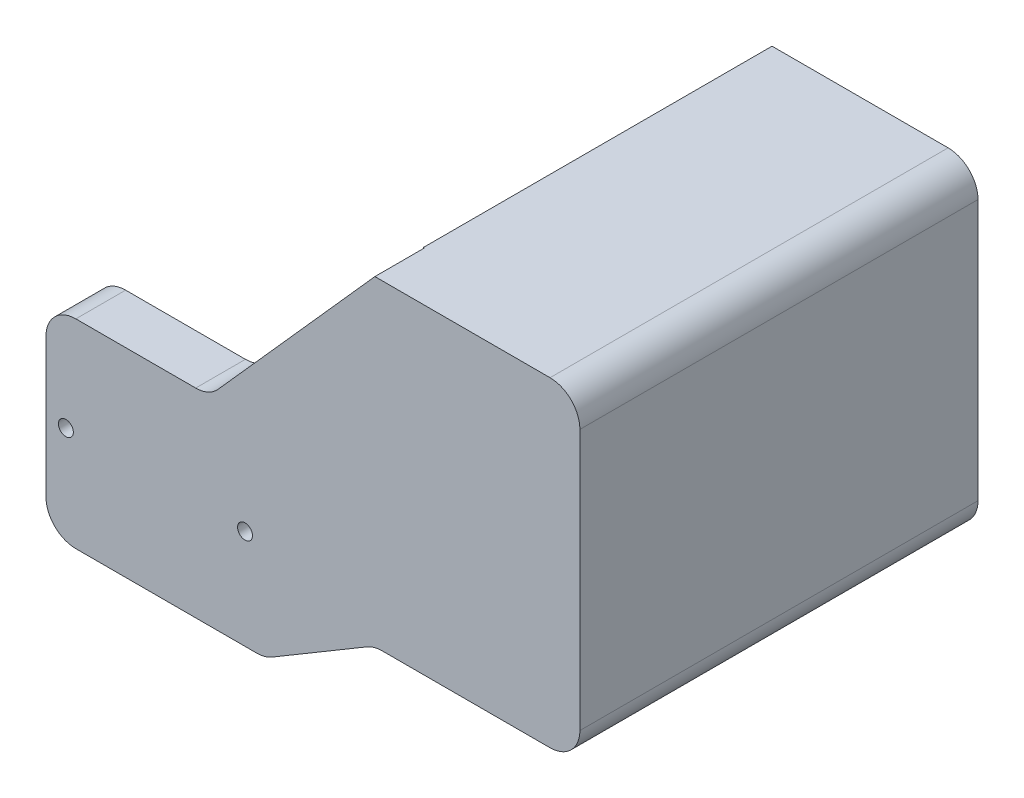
ISO-10303-21;
HEADER;
FILE_DESCRIPTION(('STEP AP214'),'2;1');
FILE_NAME('part.step','',(''),(''),'','','');
FILE_SCHEMA(('AUTOMOTIVE_DESIGN { 1 0 10303 214 1 1 1 1 }'));
ENDSEC;
DATA;
#1=APPLICATION_CONTEXT('core data for automotive mechanical design processes');
#2=APPLICATION_PROTOCOL_DEFINITION('international standard','automotive_design',2000,#1);
#3=PRODUCT_CONTEXT('',#1,'mechanical');
#4=PRODUCT('Part','Part','',(#3));
#5=PRODUCT_RELATED_PRODUCT_CATEGORY('part','',(#4));
#6=PRODUCT_DEFINITION_FORMATION('','',#4);
#7=PRODUCT_DEFINITION_CONTEXT('part definition',#1,'design');
#8=PRODUCT_DEFINITION('design','',#6,#7);
#9=PRODUCT_DEFINITION_SHAPE('','',#8);
#10=(LENGTH_UNIT() NAMED_UNIT(*) SI_UNIT(.MILLI.,.METRE.));
#11=(NAMED_UNIT(*) PLANE_ANGLE_UNIT() SI_UNIT($,.RADIAN.));
#12=(NAMED_UNIT(*) SI_UNIT($,.STERADIAN.) SOLID_ANGLE_UNIT());
#13=UNCERTAINTY_MEASURE_WITH_UNIT(LENGTH_MEASURE(1.E-05),#10,'distance_accuracy_value','');
#14=(GEOMETRIC_REPRESENTATION_CONTEXT(3) GLOBAL_UNCERTAINTY_ASSIGNED_CONTEXT((#13)) GLOBAL_UNIT_ASSIGNED_CONTEXT((#10,
#11,#12)) REPRESENTATION_CONTEXT('',''));
#15=CARTESIAN_POINT('',(0.,0.,0.));
#16=DIRECTION('',(0.,0.,1.));
#17=DIRECTION('',(1.,0.,0.));
#18=AXIS2_PLACEMENT_3D('',#15,#16,#17);
#19=CARTESIAN_POINT('',(22.0454367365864,28.7041033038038,0.));
#20=DIRECTION('',(-0.746732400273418,0.665124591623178,0.));
#21=DIRECTION('',(-0.665124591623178,-0.746732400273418,0.));
#22=AXIS2_PLACEMENT_3D('',#19,#20,#21);
#23=PLANE('',#22);
#24=DIRECTION('',(0.665124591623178,0.746732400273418,0.));
#25=VECTOR('',#24,1.);
#26=CARTESIAN_POINT('',(22.0454367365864,28.7041033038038,0.0200000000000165));
#27=LINE('',#26,#25);
#28=CARTESIAN_POINT('',(21.95,28.596956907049,0.0200000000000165));
#29=VERTEX_POINT('',#28);
#30=CARTESIAN_POINT('',(22.0454367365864,28.7041033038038,0.0200000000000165));
#31=VERTEX_POINT('',#30);
#32=EDGE_CURVE('E11',#29,#31,#27,.T.);
#33=ORIENTED_EDGE('',*,*,#32,.F.);
#34=DIRECTION('',(0.,0.,-1.));
#35=VECTOR('',#34,1.);
#36=CARTESIAN_POINT('',(21.95,28.596956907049,0.));
#37=LINE('',#36,#35);
#38=CARTESIAN_POINT('',(21.95,28.596956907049,0.));
#39=VERTEX_POINT('',#38);
#40=EDGE_CURVE('E538',#29,#39,#37,.T.);
#41=ORIENTED_EDGE('',*,*,#40,.T.);
#42=DIRECTION('',(-0.665124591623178,-0.746732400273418,0.));
#43=VECTOR('',#42,1.);
#44=CARTESIAN_POINT('',(22.0454367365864,28.7041033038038,0.));
#45=LINE('',#44,#43);
#46=CARTESIAN_POINT('',(6.28027446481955,11.0046262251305,0.));
#47=VERTEX_POINT('',#46);
#48=EDGE_CURVE('E222',#39,#47,#45,.T.);
#49=ORIENTED_EDGE('',*,*,#48,.T.);
#50=DIRECTION('',(0.,0.,1.));
#51=VECTOR('',#50,1.);
#52=CARTESIAN_POINT('',(6.28027446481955,11.0046262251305,5.));
#53=LINE('',#52,#51);
#54=CARTESIAN_POINT('',(6.28027446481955,11.0046262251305,5.));
#55=VERTEX_POINT('',#54);
#56=EDGE_CURVE('E358',#47,#55,#53,.T.);
#57=ORIENTED_EDGE('',*,*,#56,.T.);
#58=DIRECTION('',(-0.665124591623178,-0.746732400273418,0.));
#59=VECTOR('',#58,1.);
#60=CARTESIAN_POINT('',(22.0454367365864,28.7041033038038,5.));
#61=LINE('',#60,#59);
#62=CARTESIAN_POINT('',(22.0454367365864,28.7041033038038,5.));
#63=VERTEX_POINT('',#62);
#64=EDGE_CURVE('E219',#63,#55,#61,.T.);
#65=ORIENTED_EDGE('',*,*,#64,.F.);
#66=DIRECTION('',(0.,0.,1.));
#67=VECTOR('',#66,1.);
#68=CARTESIAN_POINT('',(22.0454367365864,28.7041033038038,0.));
#69=LINE('',#68,#67);
#70=EDGE_CURVE('E209',#31,#63,#69,.T.);
#71=ORIENTED_EDGE('',*,*,#70,.F.);
#72=EDGE_LOOP('',(#33,#41,#49,#57,#65,#71));
#73=FACE_BOUND('',#72,.T.);
#74=ADVANCED_FACE('F47',(#73),#23,.T.);
#75=CARTESIAN_POINT('',(0.,0.,0.));
#76=DIRECTION('',(0.,0.,-1.));
#77=DIRECTION('',(-1.,0.,0.));
#78=AXIS2_PLACEMENT_3D('',#75,#76,#77);
#79=PLANE('',#78);
#80=CARTESIAN_POINT('',(-9.00285422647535,0.,0.));
#81=DIRECTION('',(0.,0.,-1.));
#82=DIRECTION('',(-1.,0.,0.));
#83=AXIS2_PLACEMENT_3D('',#80,#81,#82);
#84=CIRCLE('',#83,0.75);
#85=CARTESIAN_POINT('',(-9.75285422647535,0.,0.));
#86=VERTEX_POINT('',#85);
#87=EDGE_CURVE('E376',#86,#86,#84,.F.);
#88=ORIENTED_EDGE('',*,*,#87,.T.);
#89=EDGE_LOOP('',(#88));
#90=FACE_BOUND('',#89,.T.);
#91=CARTESIAN_POINT('',(8.99714577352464,0.,0.));
#92=DIRECTION('',(0.,0.,-1.));
#93=DIRECTION('',(-1.,0.,0.));
#94=AXIS2_PLACEMENT_3D('',#91,#92,#93);
#95=CIRCLE('',#94,0.75);
#96=CARTESIAN_POINT('',(8.24714577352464,0.,0.));
#97=VERTEX_POINT('',#96);
#98=EDGE_CURVE('E371',#97,#97,#95,.F.);
#99=ORIENTED_EDGE('',*,*,#98,.T.);
#100=EDGE_LOOP('',(#99));
#101=FACE_BOUND('',#100,.T.);
#102=ORIENTED_EDGE('',*,*,#48,.F.);
#103=DIRECTION('',(0.,-1.,0.));
#104=VECTOR('',#103,1.);
#105=CARTESIAN_POINT('',(21.95,0.,0.));
#106=LINE('',#105,#104);
#107=CARTESIAN_POINT('',(21.95,23.7997140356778,0.));
#108=VERTEX_POINT('',#107);
#109=EDGE_CURVE('E537',#39,#108,#106,.T.);
#110=ORIENTED_EDGE('',*,*,#109,.T.);
#111=DIRECTION('',(1.,0.,0.));
#112=VECTOR('',#111,1.);
#113=CARTESIAN_POINT('',(37.6454367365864,23.7997140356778,0.));
#114=LINE('',#113,#112);
#115=CARTESIAN_POINT('',(37.6454367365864,23.7997140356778,0.));
#116=VERTEX_POINT('',#115);
#117=EDGE_CURVE('E261',#108,#116,#114,.T.);
#118=ORIENTED_EDGE('',*,*,#117,.T.);
#119=DIRECTION('',(0.,-1.,0.));
#120=VECTOR('',#119,1.);
#121=CARTESIAN_POINT('',(37.6454367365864,1.4,0.));
#122=LINE('',#121,#120);
#123=CARTESIAN_POINT('',(37.6454367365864,1.4,0.));
#124=VERTEX_POINT('',#123);
#125=EDGE_CURVE('E248',#116,#124,#122,.T.);
#126=ORIENTED_EDGE('',*,*,#125,.T.);
#127=DIRECTION('',(-1.,0.,0.));
#128=VECTOR('',#127,1.);
#129=CARTESIAN_POINT('',(21.95,1.4,0.));
#130=LINE('',#129,#128);
#131=CARTESIAN_POINT('',(21.95,1.4,0.));
#132=VERTEX_POINT('',#131);
#133=EDGE_CURVE('E269',#124,#132,#130,.T.);
#134=ORIENTED_EDGE('',*,*,#133,.T.);
#135=DIRECTION('',(0.,-1.,0.));
#136=VECTOR('',#135,1.);
#137=CARTESIAN_POINT('',(21.95,-3.5,0.));
#138=LINE('',#137,#136);
#139=CARTESIAN_POINT('',(21.95,-3.5,0.));
#140=VERTEX_POINT('',#139);
#141=EDGE_CURVE('E265',#132,#140,#138,.T.);
#142=ORIENTED_EDGE('',*,*,#141,.T.);
#143=DIRECTION('',(-1.,0.,0.));
#144=VECTOR('',#143,1.);
#145=CARTESIAN_POINT('',(0.,-3.5,0.));
#146=LINE('',#145,#144);
#147=CARTESIAN_POINT('',(22.773343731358,-3.5,0.));
#148=VERTEX_POINT('',#147);
#149=EDGE_CURVE('E345',#148,#140,#146,.T.);
#150=ORIENTED_EDGE('',*,*,#149,.F.);
#151=CARTESIAN_POINT('',(22.773343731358,-6.5,0.));
#152=DIRECTION('',(0.,0.,-1.));
#153=DIRECTION('',(-1.,0.,0.));
#154=AXIS2_PLACEMENT_3D('',#151,#152,#153);
#155=CIRCLE('',#154,3.);
#156=CARTESIAN_POINT('',(21.241999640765,-3.92027418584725,0.));
#157=VERTEX_POINT('',#156);
#158=EDGE_CURVE('E355',#148,#157,#155,.F.);
#159=ORIENTED_EDGE('',*,*,#158,.T.);
#160=DIRECTION('',(0.859908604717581,0.510448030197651,0.));
#161=VECTOR('',#160,1.);
#162=CARTESIAN_POINT('',(21.95,-3.5,0.));
#163=LINE('',#162,#161);
#164=CARTESIAN_POINT('',(11.708000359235,-9.57972581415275,0.));
#165=VERTEX_POINT('',#164);
#166=EDGE_CURVE('E228',#165,#157,#163,.T.);
#167=ORIENTED_EDGE('',*,*,#166,.F.);
#168=CARTESIAN_POINT('',(10.176656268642,-7.,0.));
#169=DIRECTION('',(0.,0.,-1.));
#170=DIRECTION('',(-1.,0.,0.));
#171=AXIS2_PLACEMENT_3D('',#168,#169,#170);
#172=CIRCLE('',#171,3.);
#173=CARTESIAN_POINT('',(10.176656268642,-10.,0.));
#174=VERTEX_POINT('',#173);
#175=EDGE_CURVE('E311',#165,#174,#172,.T.);
#176=ORIENTED_EDGE('',*,*,#175,.T.);
#177=DIRECTION('',(-1.,0.,0.));
#178=VECTOR('',#177,1.);
#179=CARTESIAN_POINT('',(11.,-10.,0.));
#180=LINE('',#179,#178);
#181=CARTESIAN_POINT('',(-8.00000000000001,-10.,0.));
#182=VERTEX_POINT('',#181);
#183=EDGE_CURVE('E407',#174,#182,#180,.T.);
#184=ORIENTED_EDGE('',*,*,#183,.T.);
#185=CARTESIAN_POINT('',(-8.,-7.,0.));
#186=DIRECTION('',(0.,0.,-1.));
#187=DIRECTION('',(-1.,0.,0.));
#188=AXIS2_PLACEMENT_3D('',#185,#186,#187);
#189=CIRCLE('',#188,3.);
#190=CARTESIAN_POINT('',(-11.,-7.,0.));
#191=VERTEX_POINT('',#190);
#192=EDGE_CURVE('E298',#182,#191,#189,.T.);
#193=ORIENTED_EDGE('',*,*,#192,.T.);
#194=DIRECTION('',(0.,1.,0.));
#195=VECTOR('',#194,1.);
#196=CARTESIAN_POINT('',(-11.,10.,0.));
#197=LINE('',#196,#195);
#198=CARTESIAN_POINT('',(-11.,7.,0.));
#199=VERTEX_POINT('',#198);
#200=EDGE_CURVE('E401',#191,#199,#197,.T.);
#201=ORIENTED_EDGE('',*,*,#200,.T.);
#202=CARTESIAN_POINT('',(-8.,7.,0.));
#203=DIRECTION('',(0.,0.,-1.));
#204=DIRECTION('',(-1.,0.,0.));
#205=AXIS2_PLACEMENT_3D('',#202,#203,#204);
#206=CIRCLE('',#205,3.);
#207=CARTESIAN_POINT('',(-8.00000000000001,10.,0.));
#208=VERTEX_POINT('',#207);
#209=EDGE_CURVE('E284',#199,#208,#206,.T.);
#210=ORIENTED_EDGE('',*,*,#209,.T.);
#211=DIRECTION('',(1.,0.,0.));
#212=VECTOR('',#211,1.);
#213=CARTESIAN_POINT('',(11.,10.,0.));
#214=LINE('',#213,#212);
#215=CARTESIAN_POINT('',(4.04007726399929,10.,0.));
#216=VERTEX_POINT('',#215);
#217=EDGE_CURVE('E404',#208,#216,#214,.T.);
#218=ORIENTED_EDGE('',*,*,#217,.T.);
#219=CARTESIAN_POINT('',(4.04007726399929,13.,0.));
#220=DIRECTION('',(0.,0.,-1.));
#221=DIRECTION('',(-1.,0.,0.));
#222=AXIS2_PLACEMENT_3D('',#219,#220,#221);
#223=CIRCLE('',#222,3.);
#224=EDGE_CURVE('E56',#216,#47,#223,.F.);
#225=ORIENTED_EDGE('',*,*,#224,.T.);
#226=EDGE_LOOP('',(#102,#110,#118,#126,#134,#142,#150,#159,#167,#176,#184,#193,#201,#210,#218,#225));
#227=FACE_BOUND('',#226,.T.);
#228=ADVANCED_FACE('F449',(#90,#101,#227),#79,.T.);
#229=CARTESIAN_POINT('',(21.95,1.4,-30.));
#230=DIRECTION('',(0.,1.,0.));
#231=DIRECTION('',(0.,0.,1.));
#232=AXIS2_PLACEMENT_3D('',#229,#230,#231);
#233=PLANE('',#232);
#234=DIRECTION('',(0.,0.,1.));
#235=VECTOR('',#234,1.);
#236=CARTESIAN_POINT('',(37.6454367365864,1.4,-30.));
#237=LINE('',#236,#235);
#238=CARTESIAN_POINT('',(37.6454367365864,1.4,-28.98));
#239=VERTEX_POINT('',#238);
#240=EDGE_CURVE('E244',#239,#124,#237,.T.);
#241=ORIENTED_EDGE('',*,*,#240,.F.);
#242=DIRECTION('',(1.,0.,0.));
#243=VECTOR('',#242,1.);
#244=CARTESIAN_POINT('',(37.6454367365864,1.4,-28.98));
#245=LINE('',#244,#243);
#246=CARTESIAN_POINT('',(21.95,1.4,-28.98));
#247=VERTEX_POINT('',#246);
#248=EDGE_CURVE('E372',#247,#239,#245,.T.);
#249=ORIENTED_EDGE('',*,*,#248,.F.);
#250=DIRECTION('',(0.,0.,1.));
#251=VECTOR('',#250,1.);
#252=CARTESIAN_POINT('',(21.95,1.4,-30.));
#253=LINE('',#252,#251);
#254=EDGE_CURVE('E245',#247,#132,#253,.T.);
#255=ORIENTED_EDGE('',*,*,#254,.T.);
#256=ORIENTED_EDGE('',*,*,#133,.F.);
#257=EDGE_LOOP('',(#241,#249,#255,#256));
#258=FACE_BOUND('',#257,.T.);
#259=ADVANCED_FACE('F454',(#258),#233,.T.);
#260=CARTESIAN_POINT('',(37.6454367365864,1.4,-30.));
#261=DIRECTION('',(-1.,0.,0.));
#262=DIRECTION('',(0.,0.,1.));
#263=AXIS2_PLACEMENT_3D('',#260,#261,#262);
#264=PLANE('',#263);
#265=DIRECTION('',(0.,0.,1.));
#266=VECTOR('',#265,1.);
#267=CARTESIAN_POINT('',(37.6454367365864,23.7997140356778,-30.));
#268=LINE('',#267,#266);
#269=CARTESIAN_POINT('',(37.6454367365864,23.7997140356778,-28.98));
#270=VERTEX_POINT('',#269);
#271=EDGE_CURVE('E253',#270,#116,#268,.T.);
#272=ORIENTED_EDGE('',*,*,#271,.F.);
#273=DIRECTION('',(0.,1.,0.));
#274=VECTOR('',#273,1.);
#275=CARTESIAN_POINT('',(37.6454367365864,23.7997140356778,-28.98));
#276=LINE('',#275,#274);
#277=EDGE_CURVE('E540',#239,#270,#276,.T.);
#278=ORIENTED_EDGE('',*,*,#277,.F.);
#279=ORIENTED_EDGE('',*,*,#240,.T.);
#280=ORIENTED_EDGE('',*,*,#125,.F.);
#281=EDGE_LOOP('',(#272,#278,#279,#280));
#282=FACE_BOUND('',#281,.T.);
#283=ADVANCED_FACE('F463',(#282),#264,.T.);
#284=CARTESIAN_POINT('',(37.6454367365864,23.7997140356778,-30.));
#285=DIRECTION('',(0.,-1.,0.));
#286=DIRECTION('',(1.,0.,0.));
#287=AXIS2_PLACEMENT_3D('',#284,#285,#286);
#288=PLANE('',#287);
#289=ORIENTED_EDGE('',*,*,#117,.F.);
#290=DIRECTION('',(0.,0.,-1.));
#291=VECTOR('',#290,1.);
#292=CARTESIAN_POINT('',(21.95,23.7997140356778,0.0200000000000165));
#293=LINE('',#292,#291);
#294=CARTESIAN_POINT('',(21.95,23.7997140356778,-28.98));
#295=VERTEX_POINT('',#294);
#296=EDGE_CURVE('E215',#108,#295,#293,.T.);
#297=ORIENTED_EDGE('',*,*,#296,.T.);
#298=DIRECTION('',(-1.,0.,0.));
#299=VECTOR('',#298,1.);
#300=CARTESIAN_POINT('',(37.6454367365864,23.7997140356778,-28.98));
#301=LINE('',#300,#299);
#302=EDGE_CURVE('E544',#270,#295,#301,.T.);
#303=ORIENTED_EDGE('',*,*,#302,.F.);
#304=ORIENTED_EDGE('',*,*,#271,.T.);
#305=EDGE_LOOP('',(#289,#297,#303,#304));
#306=FACE_BOUND('',#305,.T.);
#307=ADVANCED_FACE('F478',(#306),#288,.T.);
#308=CARTESIAN_POINT('',(22.0454367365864,28.7041033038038,-30.));
#309=DIRECTION('',(0.,1.,0.));
#310=DIRECTION('',(-1.,0.,0.));
#311=AXIS2_PLACEMENT_3D('',#308,#309,#310);
#312=PLANE('',#311);
#313=DIRECTION('',(-1.,0.,0.));
#314=VECTOR('',#313,1.);
#315=CARTESIAN_POINT('',(42.6454367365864,28.7041033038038,5.));
#316=LINE('',#315,#314);
#317=CARTESIAN_POINT('',(39.6454367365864,28.7041033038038,5.));
#318=VERTEX_POINT('',#317);
#319=EDGE_CURVE('E423',#318,#63,#316,.T.);
#320=ORIENTED_EDGE('',*,*,#319,.F.);
#321=DIRECTION('',(0.,0.,1.));
#322=VECTOR('',#321,1.);
#323=CARTESIAN_POINT('',(39.6454367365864,28.7041033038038,-30.));
#324=LINE('',#323,#322);
#325=CARTESIAN_POINT('',(39.6454367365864,28.7041033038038,-35.));
#326=VERTEX_POINT('',#325);
#327=EDGE_CURVE('E335',#318,#326,#324,.F.);
#328=ORIENTED_EDGE('',*,*,#327,.T.);
#329=DIRECTION('',(1.,0.,0.));
#330=VECTOR('',#329,1.);
#331=CARTESIAN_POINT('',(42.6454367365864,28.7041033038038,-35.));
#332=LINE('',#331,#330);
#333=CARTESIAN_POINT('',(21.95,28.7041033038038,-35.));
#334=VERTEX_POINT('',#333);
#335=EDGE_CURVE('E238',#334,#326,#332,.T.);
#336=ORIENTED_EDGE('',*,*,#335,.F.);
#337=DIRECTION('',(0.,0.,1.));
#338=VECTOR('',#337,1.);
#339=CARTESIAN_POINT('',(21.95,28.7041033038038,-35.));
#340=LINE('',#339,#338);
#341=CARTESIAN_POINT('',(21.95,28.7041033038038,0.0200000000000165));
#342=VERTEX_POINT('',#341);
#343=EDGE_CURVE('E213',#334,#342,#340,.T.);
#344=ORIENTED_EDGE('',*,*,#343,.T.);
#345=DIRECTION('',(-1.,0.,0.));
#346=VECTOR('',#345,1.);
#347=CARTESIAN_POINT('',(21.95,28.7041033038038,0.0200000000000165));
#348=LINE('',#347,#346);
#349=EDGE_CURVE('E200',#31,#342,#348,.T.);
#350=ORIENTED_EDGE('',*,*,#349,.F.);
#351=ORIENTED_EDGE('',*,*,#70,.T.);
#352=EDGE_LOOP('',(#320,#328,#336,#344,#350,#351));
#353=FACE_BOUND('',#352,.T.);
#354=ADVANCED_FACE('F208',(#353),#312,.T.);
#355=CARTESIAN_POINT('',(42.6454367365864,28.7041033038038,-30.));
#356=DIRECTION('',(1.,0.,0.));
#357=DIRECTION('',(0.,0.,-1.));
#358=AXIS2_PLACEMENT_3D('',#355,#356,#357);
#359=PLANE('',#358);
#360=DIRECTION('',(0.,-1.,0.));
#361=VECTOR('',#360,1.);
#362=CARTESIAN_POINT('',(42.6454367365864,28.7041033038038,-35.));
#363=LINE('',#362,#361);
#364=CARTESIAN_POINT('',(42.6454367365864,25.7041033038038,-35.));
#365=VERTEX_POINT('',#364);
#366=CARTESIAN_POINT('',(42.6454367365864,-0.499999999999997,-35.));
#367=VERTEX_POINT('',#366);
#368=EDGE_CURVE('E221',#365,#367,#363,.T.);
#369=ORIENTED_EDGE('',*,*,#368,.F.);
#370=DIRECTION('',(0.,0.,1.));
#371=VECTOR('',#370,1.);
#372=CARTESIAN_POINT('',(42.6454367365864,25.7041033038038,-30.));
#373=LINE('',#372,#371);
#374=CARTESIAN_POINT('',(42.6454367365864,25.7041033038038,5.));
#375=VERTEX_POINT('',#374);
#376=EDGE_CURVE('E328',#365,#375,#373,.T.);
#377=ORIENTED_EDGE('',*,*,#376,.T.);
#378=DIRECTION('',(0.,1.,0.));
#379=VECTOR('',#378,1.);
#380=CARTESIAN_POINT('',(42.6454367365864,-3.5,5.));
#381=LINE('',#380,#379);
#382=CARTESIAN_POINT('',(42.6454367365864,-0.499999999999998,5.));
#383=VERTEX_POINT('',#382);
#384=EDGE_CURVE('E420',#383,#375,#381,.T.);
#385=ORIENTED_EDGE('',*,*,#384,.F.);
#386=DIRECTION('',(0.,0.,1.));
#387=VECTOR('',#386,1.);
#388=CARTESIAN_POINT('',(42.6454367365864,-0.499999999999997,-30.));
#389=LINE('',#388,#387);
#390=EDGE_CURVE('E321',#383,#367,#389,.F.);
#391=ORIENTED_EDGE('',*,*,#390,.T.);
#392=EDGE_LOOP('',(#369,#377,#385,#391));
#393=FACE_BOUND('',#392,.T.);
#394=ADVANCED_FACE('F471',(#393),#359,.T.);
#395=CARTESIAN_POINT('',(42.6454367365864,-3.5,-30.));
#396=DIRECTION('',(0.,-1.,0.));
#397=DIRECTION('',(1.,0.,0.));
#398=AXIS2_PLACEMENT_3D('',#395,#396,#397);
#399=PLANE('',#398);
#400=DIRECTION('',(1.,0.,0.));
#401=VECTOR('',#400,1.);
#402=CARTESIAN_POINT('',(21.95,-3.5,5.));
#403=LINE('',#402,#401);
#404=CARTESIAN_POINT('',(22.773343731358,-3.5,5.));
#405=VERTEX_POINT('',#404);
#406=CARTESIAN_POINT('',(39.6454367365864,-3.5,5.));
#407=VERTEX_POINT('',#406);
#408=EDGE_CURVE('E417',#405,#407,#403,.T.);
#409=ORIENTED_EDGE('',*,*,#408,.F.);
#410=DIRECTION('',(0.,0.,1.));
#411=VECTOR('',#410,1.);
#412=CARTESIAN_POINT('',(22.773343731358,-3.5,0.));
#413=LINE('',#412,#411);
#414=EDGE_CURVE('E348',#405,#148,#413,.F.);
#415=ORIENTED_EDGE('',*,*,#414,.T.);
#416=ORIENTED_EDGE('',*,*,#149,.T.);
#417=DIRECTION('',(0.,0.,1.));
#418=VECTOR('',#417,1.);
#419=CARTESIAN_POINT('',(21.95,-3.5,-30.));
#420=LINE('',#419,#418);
#421=CARTESIAN_POINT('',(21.95,-3.5,-35.));
#422=VERTEX_POINT('',#421);
#423=EDGE_CURVE('E249',#422,#140,#420,.T.);
#424=ORIENTED_EDGE('',*,*,#423,.F.);
#425=DIRECTION('',(-1.,0.,0.));
#426=VECTOR('',#425,1.);
#427=CARTESIAN_POINT('',(42.6454367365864,-3.5,-35.));
#428=LINE('',#427,#426);
#429=CARTESIAN_POINT('',(39.6454367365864,-3.5,-35.));
#430=VERTEX_POINT('',#429);
#431=EDGE_CURVE('E226',#430,#422,#428,.T.);
#432=ORIENTED_EDGE('',*,*,#431,.F.);
#433=DIRECTION('',(0.,0.,1.));
#434=VECTOR('',#433,1.);
#435=CARTESIAN_POINT('',(39.6454367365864,-3.5,-30.));
#436=LINE('',#435,#434);
#437=EDGE_CURVE('E314',#430,#407,#436,.T.);
#438=ORIENTED_EDGE('',*,*,#437,.T.);
#439=EDGE_LOOP('',(#409,#415,#416,#424,#432,#438));
#440=FACE_BOUND('',#439,.T.);
#441=ADVANCED_FACE('F467',(#440),#399,.T.);
#442=CARTESIAN_POINT('',(21.95,-3.5,-30.));
#443=DIRECTION('',(-1.,0.,0.));
#444=DIRECTION('',(0.,0.,1.));
#445=AXIS2_PLACEMENT_3D('',#442,#443,#444);
#446=PLANE('',#445);
#447=DIRECTION('',(0.,-1.,0.));
#448=VECTOR('',#447,1.);
#449=CARTESIAN_POINT('',(21.95,28.7041033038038,0.0200000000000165));
#450=LINE('',#449,#448);
#451=EDGE_CURVE('E202',#342,#29,#450,.T.);
#452=ORIENTED_EDGE('',*,*,#451,.F.);
#453=ORIENTED_EDGE('',*,*,#343,.F.);
#454=DIRECTION('',(0.,1.,0.));
#455=VECTOR('',#454,1.);
#456=CARTESIAN_POINT('',(21.95,28.7041033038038,-35.));
#457=LINE('',#456,#455);
#458=EDGE_CURVE('E235',#422,#334,#457,.T.);
#459=ORIENTED_EDGE('',*,*,#458,.F.);
#460=ORIENTED_EDGE('',*,*,#423,.T.);
#461=ORIENTED_EDGE('',*,*,#141,.F.);
#462=ORIENTED_EDGE('',*,*,#254,.F.);
#463=DIRECTION('',(0.,-1.,0.));
#464=VECTOR('',#463,1.);
#465=CARTESIAN_POINT('',(21.95,23.7997140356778,-28.98));
#466=LINE('',#465,#464);
#467=EDGE_CURVE('E550',#295,#247,#466,.T.);
#468=ORIENTED_EDGE('',*,*,#467,.F.);
#469=ORIENTED_EDGE('',*,*,#296,.F.);
#470=ORIENTED_EDGE('',*,*,#109,.F.);
#471=ORIENTED_EDGE('',*,*,#40,.F.);
#472=EDGE_LOOP('',(#452,#453,#459,#460,#461,#462,#468,#469,#470,#471));
#473=FACE_BOUND('',#472,.T.);
#474=ADVANCED_FACE('F459',(#473),#446,.T.);
#475=CARTESIAN_POINT('',(0.,0.,-35.));
#476=DIRECTION('',(0.,0.,-1.));
#477=DIRECTION('',(-1.,0.,0.));
#478=AXIS2_PLACEMENT_3D('',#475,#476,#477);
#479=PLANE('',#478);
#480=ORIENTED_EDGE('',*,*,#335,.T.);
#481=CARTESIAN_POINT('',(39.6454367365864,25.7041033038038,-35.));
#482=DIRECTION('',(0.,0.,-1.));
#483=DIRECTION('',(-1.,0.,0.));
#484=AXIS2_PLACEMENT_3D('',#481,#482,#483);
#485=CIRCLE('',#484,3.);
#486=EDGE_CURVE('E338',#326,#365,#485,.T.);
#487=ORIENTED_EDGE('',*,*,#486,.T.);
#488=ORIENTED_EDGE('',*,*,#368,.T.);
#489=CARTESIAN_POINT('',(39.6454367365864,-0.499999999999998,-35.));
#490=DIRECTION('',(0.,0.,-1.));
#491=DIRECTION('',(-1.,0.,0.));
#492=AXIS2_PLACEMENT_3D('',#489,#490,#491);
#493=CIRCLE('',#492,3.);
#494=EDGE_CURVE('E325',#367,#430,#493,.T.);
#495=ORIENTED_EDGE('',*,*,#494,.T.);
#496=ORIENTED_EDGE('',*,*,#431,.T.);
#497=ORIENTED_EDGE('',*,*,#458,.T.);
#498=EDGE_LOOP('',(#480,#487,#488,#495,#496,#497));
#499=FACE_BOUND('',#498,.T.);
#500=ADVANCED_FACE('F442',(#499),#479,.T.);
#501=CARTESIAN_POINT('',(21.95,-3.5,0.));
#502=DIRECTION('',(0.510448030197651,-0.859908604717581,0.));
#503=DIRECTION('',(0.859908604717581,0.510448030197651,0.));
#504=AXIS2_PLACEMENT_3D('',#501,#502,#503);
#505=PLANE('',#504);
#506=ORIENTED_EDGE('',*,*,#166,.T.);
#507=DIRECTION('',(0.,0.,1.));
#508=VECTOR('',#507,1.);
#509=CARTESIAN_POINT('',(21.241999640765,-3.92027418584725,5.));
#510=LINE('',#509,#508);
#511=CARTESIAN_POINT('',(21.241999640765,-3.92027418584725,5.));
#512=VERTEX_POINT('',#511);
#513=EDGE_CURVE('E341',#157,#512,#510,.T.);
#514=ORIENTED_EDGE('',*,*,#513,.T.);
#515=DIRECTION('',(0.859908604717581,0.510448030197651,0.));
#516=VECTOR('',#515,1.);
#517=CARTESIAN_POINT('',(21.95,-3.5,5.));
#518=LINE('',#517,#516);
#519=CARTESIAN_POINT('',(11.708000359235,-9.57972581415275,5.));
#520=VERTEX_POINT('',#519);
#521=EDGE_CURVE('E410',#520,#512,#518,.T.);
#522=ORIENTED_EDGE('',*,*,#521,.F.);
#523=DIRECTION('',(0.,0.,1.));
#524=VECTOR('',#523,1.);
#525=CARTESIAN_POINT('',(11.708000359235,-9.57972581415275,0.));
#526=LINE('',#525,#524);
#527=EDGE_CURVE('E308',#520,#165,#526,.F.);
#528=ORIENTED_EDGE('',*,*,#527,.T.);
#529=EDGE_LOOP('',(#506,#514,#522,#528));
#530=FACE_BOUND('',#529,.T.);
#531=ADVANCED_FACE('F430',(#530),#505,.T.);
#532=CARTESIAN_POINT('',(0.,0.,5.));
#533=DIRECTION('',(0.,0.,-1.));
#534=DIRECTION('',(-1.,0.,0.));
#535=AXIS2_PLACEMENT_3D('',#532,#533,#534);
#536=PLANE('',#535);
#537=CARTESIAN_POINT('',(-9.00285422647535,0.,5.));
#538=DIRECTION('',(0.,0.,-1.));
#539=DIRECTION('',(-1.,0.,0.));
#540=AXIS2_PLACEMENT_3D('',#537,#538,#539);
#541=CIRCLE('',#540,0.75);
#542=CARTESIAN_POINT('',(-9.75285422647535,0.,5.));
#543=VERTEX_POINT('',#542);
#544=EDGE_CURVE('E373',#543,#543,#541,.F.);
#545=ORIENTED_EDGE('',*,*,#544,.F.);
#546=EDGE_LOOP('',(#545));
#547=FACE_BOUND('',#546,.T.);
#548=CARTESIAN_POINT('',(8.99714577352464,0.,5.));
#549=DIRECTION('',(0.,0.,-1.));
#550=DIRECTION('',(-1.,0.,0.));
#551=AXIS2_PLACEMENT_3D('',#548,#549,#550);
#552=CIRCLE('',#551,0.75);
#553=CARTESIAN_POINT('',(8.24714577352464,0.,5.));
#554=VERTEX_POINT('',#553);
#555=EDGE_CURVE('E368',#554,#554,#552,.F.);
#556=ORIENTED_EDGE('',*,*,#555,.F.);
#557=EDGE_LOOP('',(#556));
#558=FACE_BOUND('',#557,.T.);
#559=ORIENTED_EDGE('',*,*,#384,.T.);
#560=CARTESIAN_POINT('',(39.6454367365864,25.7041033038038,5.));
#561=DIRECTION('',(0.,0.,-1.));
#562=DIRECTION('',(-1.,0.,0.));
#563=AXIS2_PLACEMENT_3D('',#560,#561,#562);
#564=CIRCLE('',#563,3.);
#565=EDGE_CURVE('E332',#375,#318,#564,.F.);
#566=ORIENTED_EDGE('',*,*,#565,.T.);
#567=ORIENTED_EDGE('',*,*,#319,.T.);
#568=ORIENTED_EDGE('',*,*,#64,.T.);
#569=CARTESIAN_POINT('',(4.04007726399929,13.,5.));
#570=DIRECTION('',(0.,0.,-1.));
#571=DIRECTION('',(-1.,0.,0.));
#572=AXIS2_PLACEMENT_3D('',#569,#570,#571);
#573=CIRCLE('',#572,3.);
#574=CARTESIAN_POINT('',(4.04007726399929,10.,5.));
#575=VERTEX_POINT('',#574);
#576=EDGE_CURVE('E63',#55,#575,#573,.T.);
#577=ORIENTED_EDGE('',*,*,#576,.T.);
#578=DIRECTION('',(-1.,0.,0.));
#579=VECTOR('',#578,1.);
#580=CARTESIAN_POINT('',(-11.,10.,5.));
#581=LINE('',#580,#579);
#582=CARTESIAN_POINT('',(-8.,10.,5.));
#583=VERTEX_POINT('',#582);
#584=EDGE_CURVE('E382',#575,#583,#581,.T.);
#585=ORIENTED_EDGE('',*,*,#584,.T.);
#586=CARTESIAN_POINT('',(-8.,7.,5.));
#587=DIRECTION('',(0.,0.,-1.));
#588=DIRECTION('',(-1.,0.,0.));
#589=AXIS2_PLACEMENT_3D('',#586,#587,#588);
#590=CIRCLE('',#589,3.);
#591=CARTESIAN_POINT('',(-11.,7.,5.));
#592=VERTEX_POINT('',#591);
#593=EDGE_CURVE('E277',#583,#592,#590,.F.);
#594=ORIENTED_EDGE('',*,*,#593,.T.);
#595=DIRECTION('',(0.,-1.,0.));
#596=VECTOR('',#595,1.);
#597=CARTESIAN_POINT('',(-11.,10.,5.));
#598=LINE('',#597,#596);
#599=CARTESIAN_POINT('',(-11.,-7.,5.));
#600=VERTEX_POINT('',#599);
#601=EDGE_CURVE('E393',#592,#600,#598,.T.);
#602=ORIENTED_EDGE('',*,*,#601,.T.);
#603=CARTESIAN_POINT('',(-8.,-7.,5.));
#604=DIRECTION('',(0.,0.,-1.));
#605=DIRECTION('',(-1.,0.,0.));
#606=AXIS2_PLACEMENT_3D('',#603,#604,#605);
#607=CIRCLE('',#606,3.);
#608=CARTESIAN_POINT('',(-8.,-10.,5.));
#609=VERTEX_POINT('',#608);
#610=EDGE_CURVE('E291',#600,#609,#607,.F.);
#611=ORIENTED_EDGE('',*,*,#610,.T.);
#612=DIRECTION('',(1.,0.,0.));
#613=VECTOR('',#612,1.);
#614=CARTESIAN_POINT('',(-11.,-10.,5.));
#615=LINE('',#614,#613);
#616=CARTESIAN_POINT('',(10.176656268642,-10.,5.));
#617=VERTEX_POINT('',#616);
#618=EDGE_CURVE('E397',#609,#617,#615,.T.);
#619=ORIENTED_EDGE('',*,*,#618,.T.);
#620=CARTESIAN_POINT('',(10.176656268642,-7.,5.));
#621=DIRECTION('',(0.,0.,-1.));
#622=DIRECTION('',(-1.,0.,0.));
#623=AXIS2_PLACEMENT_3D('',#620,#621,#622);
#624=CIRCLE('',#623,3.);
#625=EDGE_CURVE('E305',#617,#520,#624,.F.);
#626=ORIENTED_EDGE('',*,*,#625,.T.);
#627=ORIENTED_EDGE('',*,*,#521,.T.);
#628=CARTESIAN_POINT('',(22.773343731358,-6.5,5.));
#629=DIRECTION('',(0.,0.,-1.));
#630=DIRECTION('',(-1.,0.,0.));
#631=AXIS2_PLACEMENT_3D('',#628,#629,#630);
#632=CIRCLE('',#631,3.);
#633=EDGE_CURVE('E352',#512,#405,#632,.T.);
#634=ORIENTED_EDGE('',*,*,#633,.T.);
#635=ORIENTED_EDGE('',*,*,#408,.T.);
#636=CARTESIAN_POINT('',(39.6454367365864,-0.499999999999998,5.));
#637=DIRECTION('',(0.,0.,-1.));
#638=DIRECTION('',(-1.,0.,0.));
#639=AXIS2_PLACEMENT_3D('',#636,#637,#638);
#640=CIRCLE('',#639,3.);
#641=EDGE_CURVE('E318',#407,#383,#640,.F.);
#642=ORIENTED_EDGE('',*,*,#641,.T.);
#643=EDGE_LOOP('',(#559,#566,#567,#568,#577,#585,#594,#602,#611,#619,#626,#627,#634,#635,#642));
#644=FACE_BOUND('',#643,.T.);
#645=ADVANCED_FACE('F426',(#547,#558,#644),#536,.F.);
#646=CARTESIAN_POINT('',(-11.,-10.,-30.));
#647=DIRECTION('',(0.,-1.,0.));
#648=DIRECTION('',(0.,0.,-1.));
#649=AXIS2_PLACEMENT_3D('',#646,#647,#648);
#650=PLANE('',#649);
#651=ORIENTED_EDGE('',*,*,#183,.F.);
#652=DIRECTION('',(0.,0.,1.));
#653=VECTOR('',#652,1.);
#654=CARTESIAN_POINT('',(10.176656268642,-10.,-30.));
#655=LINE('',#654,#653);
#656=EDGE_CURVE('E301',#174,#617,#655,.T.);
#657=ORIENTED_EDGE('',*,*,#656,.T.);
#658=ORIENTED_EDGE('',*,*,#618,.F.);
#659=DIRECTION('',(0.,0.,1.));
#660=VECTOR('',#659,1.);
#661=CARTESIAN_POINT('',(-8.,-10.,-30.));
#662=LINE('',#661,#660);
#663=EDGE_CURVE('E294',#609,#182,#662,.F.);
#664=ORIENTED_EDGE('',*,*,#663,.T.);
#665=EDGE_LOOP('',(#651,#657,#658,#664));
#666=FACE_BOUND('',#665,.T.);
#667=ADVANCED_FACE('F429',(#666),#650,.T.);
#668=CARTESIAN_POINT('',(-11.,10.,-30.));
#669=DIRECTION('',(-1.,0.,0.));
#670=DIRECTION('',(0.,0.,1.));
#671=AXIS2_PLACEMENT_3D('',#668,#669,#670);
#672=PLANE('',#671);
#673=ORIENTED_EDGE('',*,*,#200,.F.);
#674=DIRECTION('',(0.,0.,1.));
#675=VECTOR('',#674,1.);
#676=CARTESIAN_POINT('',(-11.,-7.,-30.));
#677=LINE('',#676,#675);
#678=EDGE_CURVE('E287',#191,#600,#677,.T.);
#679=ORIENTED_EDGE('',*,*,#678,.T.);
#680=ORIENTED_EDGE('',*,*,#601,.F.);
#681=DIRECTION('',(0.,0.,1.));
#682=VECTOR('',#681,1.);
#683=CARTESIAN_POINT('',(-11.,7.,-30.));
#684=LINE('',#683,#682);
#685=EDGE_CURVE('E280',#592,#199,#684,.F.);
#686=ORIENTED_EDGE('',*,*,#685,.T.);
#687=EDGE_LOOP('',(#673,#679,#680,#686));
#688=FACE_BOUND('',#687,.T.);
#689=ADVANCED_FACE('F438',(#688),#672,.T.);
#690=CARTESIAN_POINT('',(-11.,10.,-30.));
#691=DIRECTION('',(0.,1.,0.));
#692=DIRECTION('',(0.,0.,1.));
#693=AXIS2_PLACEMENT_3D('',#690,#691,#692);
#694=PLANE('',#693);
#695=ORIENTED_EDGE('',*,*,#584,.F.);
#696=DIRECTION('',(0.,0.,1.));
#697=VECTOR('',#696,1.);
#698=CARTESIAN_POINT('',(4.04007726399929,10.,0.));
#699=LINE('',#698,#697);
#700=EDGE_CURVE('E70',#575,#216,#699,.F.);
#701=ORIENTED_EDGE('',*,*,#700,.T.);
#702=ORIENTED_EDGE('',*,*,#217,.F.);
#703=DIRECTION('',(0.,0.,1.));
#704=VECTOR('',#703,1.);
#705=CARTESIAN_POINT('',(-8.,10.,-30.));
#706=LINE('',#705,#704);
#707=EDGE_CURVE('E273',#208,#583,#706,.T.);
#708=ORIENTED_EDGE('',*,*,#707,.T.);
#709=EDGE_LOOP('',(#695,#701,#702,#708));
#710=FACE_BOUND('',#709,.T.);
#711=ADVANCED_FACE('F488',(#710),#694,.T.);
#712=CARTESIAN_POINT('',(-8.,7.,-30.));
#713=DIRECTION('',(0.,0.,1.));
#714=DIRECTION('',(1.,0.,0.));
#715=AXIS2_PLACEMENT_3D('',#712,#713,#714);
#716=CYLINDRICAL_SURFACE('',#715,3.);
#717=ORIENTED_EDGE('',*,*,#209,.F.);
#718=ORIENTED_EDGE('',*,*,#685,.F.);
#719=ORIENTED_EDGE('',*,*,#593,.F.);
#720=ORIENTED_EDGE('',*,*,#707,.F.);
#721=EDGE_LOOP('',(#717,#718,#719,#720));
#722=FACE_BOUND('',#721,.T.);
#723=ADVANCED_FACE('F484',(#722),#716,.T.);
#724=CARTESIAN_POINT('',(-8.,-7.,-30.));
#725=DIRECTION('',(0.,0.,1.));
#726=DIRECTION('',(1.,0.,0.));
#727=AXIS2_PLACEMENT_3D('',#724,#725,#726);
#728=CYLINDRICAL_SURFACE('',#727,3.);
#729=ORIENTED_EDGE('',*,*,#192,.F.);
#730=ORIENTED_EDGE('',*,*,#663,.F.);
#731=ORIENTED_EDGE('',*,*,#610,.F.);
#732=ORIENTED_EDGE('',*,*,#678,.F.);
#733=EDGE_LOOP('',(#729,#730,#731,#732));
#734=FACE_BOUND('',#733,.T.);
#735=ADVANCED_FACE('F487',(#734),#728,.T.);
#736=CARTESIAN_POINT('',(10.176656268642,-7.,-30.));
#737=DIRECTION('',(0.,0.,1.));
#738=DIRECTION('',(1.,0.,0.));
#739=AXIS2_PLACEMENT_3D('',#736,#737,#738);
#740=CYLINDRICAL_SURFACE('',#739,3.);
#741=ORIENTED_EDGE('',*,*,#175,.F.);
#742=ORIENTED_EDGE('',*,*,#527,.F.);
#743=ORIENTED_EDGE('',*,*,#625,.F.);
#744=ORIENTED_EDGE('',*,*,#656,.F.);
#745=EDGE_LOOP('',(#741,#742,#743,#744));
#746=FACE_BOUND('',#745,.T.);
#747=ADVANCED_FACE('F492',(#746),#740,.T.);
#748=CARTESIAN_POINT('',(39.6454367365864,-0.499999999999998,-30.));
#749=DIRECTION('',(0.,0.,1.));
#750=DIRECTION('',(1.,0.,0.));
#751=AXIS2_PLACEMENT_3D('',#748,#749,#750);
#752=CYLINDRICAL_SURFACE('',#751,3.);
#753=ORIENTED_EDGE('',*,*,#494,.F.);
#754=ORIENTED_EDGE('',*,*,#390,.F.);
#755=ORIENTED_EDGE('',*,*,#641,.F.);
#756=ORIENTED_EDGE('',*,*,#437,.F.);
#757=EDGE_LOOP('',(#753,#754,#755,#756));
#758=FACE_BOUND('',#757,.T.);
#759=ADVANCED_FACE('F496',(#758),#752,.T.);
#760=CARTESIAN_POINT('',(39.6454367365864,25.7041033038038,-30.));
#761=DIRECTION('',(0.,0.,1.));
#762=DIRECTION('',(1.,0.,0.));
#763=AXIS2_PLACEMENT_3D('',#760,#761,#762);
#764=CYLINDRICAL_SURFACE('',#763,3.);
#765=ORIENTED_EDGE('',*,*,#486,.F.);
#766=ORIENTED_EDGE('',*,*,#327,.F.);
#767=ORIENTED_EDGE('',*,*,#565,.F.);
#768=ORIENTED_EDGE('',*,*,#376,.F.);
#769=EDGE_LOOP('',(#765,#766,#767,#768));
#770=FACE_BOUND('',#769,.T.);
#771=ADVANCED_FACE('F500',(#770),#764,.T.);
#772=CARTESIAN_POINT('',(22.773343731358,-6.5,0.));
#773=DIRECTION('',(0.,0.,-1.));
#774=DIRECTION('',(-1.,0.,0.));
#775=AXIS2_PLACEMENT_3D('',#772,#773,#774);
#776=CYLINDRICAL_SURFACE('',#775,3.);
#777=ORIENTED_EDGE('',*,*,#158,.F.);
#778=ORIENTED_EDGE('',*,*,#414,.F.);
#779=ORIENTED_EDGE('',*,*,#633,.F.);
#780=ORIENTED_EDGE('',*,*,#513,.F.);
#781=EDGE_LOOP('',(#777,#778,#779,#780));
#782=FACE_BOUND('',#781,.T.);
#783=ADVANCED_FACE('F503',(#782),#776,.F.);
#784=CARTESIAN_POINT('',(4.04007726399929,13.,0.));
#785=DIRECTION('',(0.,0.,-1.));
#786=DIRECTION('',(-1.,0.,0.));
#787=AXIS2_PLACEMENT_3D('',#784,#785,#786);
#788=CYLINDRICAL_SURFACE('',#787,3.);
#789=ORIENTED_EDGE('',*,*,#224,.F.);
#790=ORIENTED_EDGE('',*,*,#700,.F.);
#791=ORIENTED_EDGE('',*,*,#576,.F.);
#792=ORIENTED_EDGE('',*,*,#56,.F.);
#793=EDGE_LOOP('',(#789,#790,#791,#792));
#794=FACE_BOUND('',#793,.T.);
#795=ADVANCED_FACE('F49',(#794),#788,.F.);
#796=CARTESIAN_POINT('',(8.99714577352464,0.,15.));
#797=DIRECTION('',(0.,0.,-1.));
#798=DIRECTION('',(-1.,0.,0.));
#799=AXIS2_PLACEMENT_3D('',#796,#797,#798);
#800=CYLINDRICAL_SURFACE('',#799,0.75);
#801=ORIENTED_EDGE('',*,*,#98,.F.);
#802=EDGE_LOOP('',(#801));
#803=FACE_BOUND('',#802,.T.);
#804=ORIENTED_EDGE('',*,*,#555,.T.);
#805=EDGE_LOOP('',(#804));
#806=FACE_BOUND('',#805,.T.);
#807=ADVANCED_FACE('F510',(#803,#806),#800,.F.);
#808=CARTESIAN_POINT('',(-9.00285422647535,0.,15.));
#809=DIRECTION('',(0.,0.,-1.));
#810=DIRECTION('',(-1.,0.,0.));
#811=AXIS2_PLACEMENT_3D('',#808,#809,#810);
#812=CYLINDRICAL_SURFACE('',#811,0.75);
#813=ORIENTED_EDGE('',*,*,#87,.F.);
#814=EDGE_LOOP('',(#813));
#815=FACE_BOUND('',#814,.T.);
#816=ORIENTED_EDGE('',*,*,#544,.T.);
#817=EDGE_LOOP('',(#816));
#818=FACE_BOUND('',#817,.T.);
#819=ADVANCED_FACE('F583',(#815,#818),#812,.F.);
#820=CARTESIAN_POINT('',(0.,0.,-28.98));
#821=DIRECTION('',(0.,0.,-1.));
#822=DIRECTION('',(-1.,0.,0.));
#823=AXIS2_PLACEMENT_3D('',#820,#821,#822);
#824=PLANE('',#823);
#825=ORIENTED_EDGE('',*,*,#277,.T.);
#826=ORIENTED_EDGE('',*,*,#302,.T.);
#827=ORIENTED_EDGE('',*,*,#467,.T.);
#828=ORIENTED_EDGE('',*,*,#248,.T.);
#829=EDGE_LOOP('',(#825,#826,#827,#828));
#830=FACE_BOUND('',#829,.T.);
#831=ADVANCED_FACE('F557',(#830),#824,.F.);
#832=CARTESIAN_POINT('',(0.,0.,0.0200000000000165));
#833=DIRECTION('',(0.,0.,1.));
#834=DIRECTION('',(1.,0.,0.));
#835=AXIS2_PLACEMENT_3D('',#832,#833,#834);
#836=PLANE('',#835);
#837=ORIENTED_EDGE('',*,*,#451,.T.);
#838=ORIENTED_EDGE('',*,*,#32,.T.);
#839=ORIENTED_EDGE('',*,*,#349,.T.);
#840=EDGE_LOOP('',(#837,#838,#839));
#841=FACE_BOUND('',#840,.T.);
#842=ADVANCED_FACE('F199',(#841),#836,.T.);
#843=CLOSED_SHELL('',(#74,#228,#259,#283,#307,#354,#394,#441,#474,#500,#531,#645,#667,#689,#711,
#723,#735,#747,#759,#771,#783,#795,#807,#819,#831,#842));
#844=MANIFOLD_SOLID_BREP('B2',#843);
#845=ADVANCED_BREP_SHAPE_REPRESENTATION('',(#18,#844),#14);
#846=SHAPE_DEFINITION_REPRESENTATION(#9,#845);
ENDSEC;
END-ISO-10303-21;
